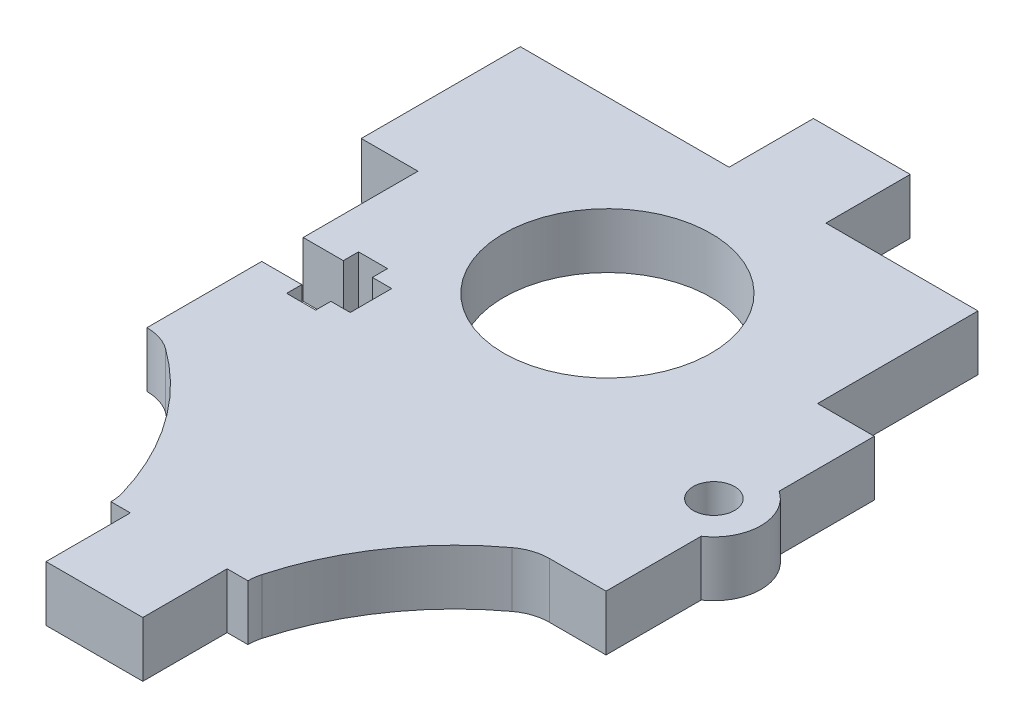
ISO-10303-21;
HEADER;
FILE_DESCRIPTION(('STEP AP214'),'2;1');
FILE_NAME('part.step','',(''),(''),'','','');
FILE_SCHEMA(('AUTOMOTIVE_DESIGN { 1 0 10303 214 1 1 1 1 }'));
ENDSEC;
DATA;
#1=APPLICATION_CONTEXT('core data for automotive mechanical design processes');
#2=APPLICATION_PROTOCOL_DEFINITION('international standard','automotive_design',2000,#1);
#3=PRODUCT_CONTEXT('',#1,'mechanical');
#4=PRODUCT('Part','Part','',(#3));
#5=PRODUCT_RELATED_PRODUCT_CATEGORY('part','',(#4));
#6=PRODUCT_DEFINITION_FORMATION('','',#4);
#7=PRODUCT_DEFINITION_CONTEXT('part definition',#1,'design');
#8=PRODUCT_DEFINITION('design','',#6,#7);
#9=PRODUCT_DEFINITION_SHAPE('','',#8);
#10=(LENGTH_UNIT() NAMED_UNIT(*) SI_UNIT(.MILLI.,.METRE.));
#11=(NAMED_UNIT(*) PLANE_ANGLE_UNIT() SI_UNIT($,.RADIAN.));
#12=(NAMED_UNIT(*) SI_UNIT($,.STERADIAN.) SOLID_ANGLE_UNIT());
#13=UNCERTAINTY_MEASURE_WITH_UNIT(LENGTH_MEASURE(1.E-05),#10,'distance_accuracy_value','');
#14=(GEOMETRIC_REPRESENTATION_CONTEXT(3) GLOBAL_UNCERTAINTY_ASSIGNED_CONTEXT((#13)) GLOBAL_UNIT_ASSIGNED_CONTEXT((#10,
#11,#12)) REPRESENTATION_CONTEXT('',''));
#15=CARTESIAN_POINT('',(0.,0.,0.));
#16=DIRECTION('',(0.,0.,1.));
#17=DIRECTION('',(1.,0.,0.));
#18=AXIS2_PLACEMENT_3D('',#15,#16,#17);
#19=CARTESIAN_POINT('',(-9.5,-2.,-2.6));
#20=DIRECTION('',(-1.,0.,0.));
#21=DIRECTION('',(0.,0.,1.));
#22=AXIS2_PLACEMENT_3D('',#19,#20,#21);
#23=PLANE('',#22);
#24=DIRECTION('',(0.,1.,0.));
#25=VECTOR('',#24,1.);
#26=CARTESIAN_POINT('',(-9.5,-2.,-2.6));
#27=LINE('',#26,#25);
#28=CARTESIAN_POINT('',(-9.5,-2.,-2.6));
#29=VERTEX_POINT('',#28);
#30=CARTESIAN_POINT('',(-9.5,2.,-2.6));
#31=VERTEX_POINT('',#30);
#32=EDGE_CURVE('E604',#29,#31,#27,.T.);
#33=ORIENTED_EDGE('',*,*,#32,.F.);
#34=DIRECTION('',(0.,0.,1.));
#35=VECTOR('',#34,1.);
#36=CARTESIAN_POINT('',(-9.5,-2.,-2.6));
#37=LINE('',#36,#35);
#38=CARTESIAN_POINT('',(-9.5,-2.,-1.5));
#39=VERTEX_POINT('',#38);
#40=EDGE_CURVE('E423',#29,#39,#37,.T.);
#41=ORIENTED_EDGE('',*,*,#40,.T.);
#42=DIRECTION('',(0.,1.,0.));
#43=VECTOR('',#42,1.);
#44=CARTESIAN_POINT('',(-9.5,-2.,-1.5));
#45=LINE('',#44,#43);
#46=CARTESIAN_POINT('',(-9.5,2.,-1.5));
#47=VERTEX_POINT('',#46);
#48=EDGE_CURVE('E693',#47,#39,#45,.F.);
#49=ORIENTED_EDGE('',*,*,#48,.F.);
#50=DIRECTION('',(0.,0.,1.));
#51=VECTOR('',#50,1.);
#52=CARTESIAN_POINT('',(-9.5,2.,0.));
#53=LINE('',#52,#51);
#54=EDGE_CURVE('E419',#31,#47,#53,.T.);
#55=ORIENTED_EDGE('',*,*,#54,.F.);
#56=EDGE_LOOP('',(#33,#41,#49,#55));
#57=FACE_BOUND('',#56,.T.);
#58=ADVANCED_FACE('F17',(#57),#23,.T.);
#59=CARTESIAN_POINT('',(-11.6,-2.,-1.5));
#60=DIRECTION('',(1.,0.,0.));
#61=DIRECTION('',(0.,0.,-1.));
#62=AXIS2_PLACEMENT_3D('',#59,#60,#61);
#63=PLANE('',#62);
#64=DIRECTION('',(0.,1.,0.));
#65=VECTOR('',#64,1.);
#66=CARTESIAN_POINT('',(-11.6,-2.,-1.5));
#67=LINE('',#66,#65);
#68=CARTESIAN_POINT('',(-11.6,-2.,-1.5));
#69=VERTEX_POINT('',#68);
#70=CARTESIAN_POINT('',(-11.6,2.,-1.5));
#71=VERTEX_POINT('',#70);
#72=EDGE_CURVE('E612',#69,#71,#67,.T.);
#73=ORIENTED_EDGE('',*,*,#72,.F.);
#74=DIRECTION('',(0.,0.,-1.));
#75=VECTOR('',#74,1.);
#76=CARTESIAN_POINT('',(-11.6,-2.,-1.5));
#77=LINE('',#76,#75);
#78=CARTESIAN_POINT('',(-11.6,-2.,-2.6));
#79=VERTEX_POINT('',#78);
#80=EDGE_CURVE('E699',#69,#79,#77,.T.);
#81=ORIENTED_EDGE('',*,*,#80,.T.);
#82=DIRECTION('',(0.,1.,0.));
#83=VECTOR('',#82,1.);
#84=CARTESIAN_POINT('',(-11.6,-2.,-2.6));
#85=LINE('',#84,#83);
#86=CARTESIAN_POINT('',(-11.6,2.,-2.6));
#87=VERTEX_POINT('',#86);
#88=EDGE_CURVE('E596',#87,#79,#85,.F.);
#89=ORIENTED_EDGE('',*,*,#88,.F.);
#90=DIRECTION('',(0.,0.,1.));
#91=VECTOR('',#90,1.);
#92=CARTESIAN_POINT('',(-11.6,2.,0.));
#93=LINE('',#92,#91);
#94=EDGE_CURVE('E412',#71,#87,#93,.F.);
#95=ORIENTED_EDGE('',*,*,#94,.F.);
#96=EDGE_LOOP('',(#73,#81,#89,#95));
#97=FACE_BOUND('',#96,.T.);
#98=ADVANCED_FACE('F732',(#97),#63,.T.);
#99=CARTESIAN_POINT('',(-8.1,-2.,1.5));
#100=DIRECTION('',(0.,0.,-1.));
#101=DIRECTION('',(-1.,0.,0.));
#102=AXIS2_PLACEMENT_3D('',#99,#100,#101);
#103=PLANE('',#102);
#104=DIRECTION('',(0.,1.,0.));
#105=VECTOR('',#104,1.);
#106=CARTESIAN_POINT('',(-8.1,-2.,1.5));
#107=LINE('',#106,#105);
#108=CARTESIAN_POINT('',(-8.1,-2.,1.5));
#109=VERTEX_POINT('',#108);
#110=CARTESIAN_POINT('',(-8.1,2.,1.5));
#111=VERTEX_POINT('',#110);
#112=EDGE_CURVE('E593',#109,#111,#107,.T.);
#113=ORIENTED_EDGE('',*,*,#112,.F.);
#114=DIRECTION('',(-1.,0.,0.));
#115=VECTOR('',#114,1.);
#116=CARTESIAN_POINT('',(-8.1,-2.,1.5));
#117=LINE('',#116,#115);
#118=CARTESIAN_POINT('',(-9.5,-2.,1.5));
#119=VERTEX_POINT('',#118);
#120=EDGE_CURVE('E697',#109,#119,#117,.T.);
#121=ORIENTED_EDGE('',*,*,#120,.T.);
#122=DIRECTION('',(0.,1.,0.));
#123=VECTOR('',#122,1.);
#124=CARTESIAN_POINT('',(-9.5,-2.,1.5));
#125=LINE('',#124,#123);
#126=CARTESIAN_POINT('',(-9.5,2.,1.5));
#127=VERTEX_POINT('',#126);
#128=EDGE_CURVE('E686',#127,#119,#125,.F.);
#129=ORIENTED_EDGE('',*,*,#128,.F.);
#130=DIRECTION('',(1.,0.,0.));
#131=VECTOR('',#130,1.);
#132=CARTESIAN_POINT('',(0.,2.,1.5));
#133=LINE('',#132,#131);
#134=EDGE_CURVE('E638',#111,#127,#133,.F.);
#135=ORIENTED_EDGE('',*,*,#134,.F.);
#136=EDGE_LOOP('',(#113,#121,#129,#135));
#137=FACE_BOUND('',#136,.T.);
#138=ADVANCED_FACE('F1092',(#137),#103,.T.);
#139=CARTESIAN_POINT('',(-9.5,-2.,-1.5));
#140=DIRECTION('',(0.,0.,1.));
#141=DIRECTION('',(1.,0.,0.));
#142=AXIS2_PLACEMENT_3D('',#139,#140,#141);
#143=PLANE('',#142);
#144=ORIENTED_EDGE('',*,*,#48,.T.);
#145=DIRECTION('',(1.,0.,0.));
#146=VECTOR('',#145,1.);
#147=CARTESIAN_POINT('',(-9.5,-2.,-1.5));
#148=LINE('',#147,#146);
#149=CARTESIAN_POINT('',(-8.1,-2.,-1.5));
#150=VERTEX_POINT('',#149);
#151=EDGE_CURVE('E690',#39,#150,#148,.T.);
#152=ORIENTED_EDGE('',*,*,#151,.T.);
#153=DIRECTION('',(0.,1.,0.));
#154=VECTOR('',#153,1.);
#155=CARTESIAN_POINT('',(-8.1,-2.,-1.5));
#156=LINE('',#155,#154);
#157=CARTESIAN_POINT('',(-8.1,2.,-1.5));
#158=VERTEX_POINT('',#157);
#159=EDGE_CURVE('E448',#158,#150,#156,.F.);
#160=ORIENTED_EDGE('',*,*,#159,.F.);
#161=DIRECTION('',(1.,0.,0.));
#162=VECTOR('',#161,1.);
#163=CARTESIAN_POINT('',(0.,2.,-1.5));
#164=LINE('',#163,#162);
#165=EDGE_CURVE('E641',#47,#158,#164,.T.);
#166=ORIENTED_EDGE('',*,*,#165,.F.);
#167=EDGE_LOOP('',(#144,#152,#160,#166));
#168=FACE_BOUND('',#167,.T.);
#169=ADVANCED_FACE('F714',(#168),#143,.T.);
#170=CARTESIAN_POINT('',(-9.5,-2.,1.5));
#171=DIRECTION('',(-1.,0.,0.));
#172=DIRECTION('',(0.,0.,1.));
#173=AXIS2_PLACEMENT_3D('',#170,#171,#172);
#174=PLANE('',#173);
#175=ORIENTED_EDGE('',*,*,#128,.T.);
#176=DIRECTION('',(0.,0.,1.));
#177=VECTOR('',#176,1.);
#178=CARTESIAN_POINT('',(-9.5,-2.,1.5));
#179=LINE('',#178,#177);
#180=CARTESIAN_POINT('',(-9.5,-2.,2.6));
#181=VERTEX_POINT('',#180);
#182=EDGE_CURVE('E678',#119,#181,#179,.T.);
#183=ORIENTED_EDGE('',*,*,#182,.T.);
#184=DIRECTION('',(0.,1.,0.));
#185=VECTOR('',#184,1.);
#186=CARTESIAN_POINT('',(-9.5,-2.,2.6));
#187=LINE('',#186,#185);
#188=CARTESIAN_POINT('',(-9.5,2.,2.6));
#189=VERTEX_POINT('',#188);
#190=EDGE_CURVE('E453',#189,#181,#187,.F.);
#191=ORIENTED_EDGE('',*,*,#190,.F.);
#192=DIRECTION('',(0.,0.,1.));
#193=VECTOR('',#192,1.);
#194=CARTESIAN_POINT('',(-9.5,2.,0.));
#195=LINE('',#194,#193);
#196=EDGE_CURVE('E635',#127,#189,#195,.T.);
#197=ORIENTED_EDGE('',*,*,#196,.F.);
#198=EDGE_LOOP('',(#175,#183,#191,#197));
#199=FACE_BOUND('',#198,.T.);
#200=ADVANCED_FACE('F1077',(#199),#174,.T.);
#201=CARTESIAN_POINT('',(-11.6,-2.,2.6));
#202=DIRECTION('',(1.,0.,0.));
#203=DIRECTION('',(0.,0.,-1.));
#204=AXIS2_PLACEMENT_3D('',#201,#202,#203);
#205=PLANE('',#204);
#206=DIRECTION('',(0.,1.,0.));
#207=VECTOR('',#206,1.);
#208=CARTESIAN_POINT('',(-11.6,-2.,2.6));
#209=LINE('',#208,#207);
#210=CARTESIAN_POINT('',(-11.6,-2.,2.6));
#211=VERTEX_POINT('',#210);
#212=CARTESIAN_POINT('',(-11.6,2.,2.6));
#213=VERTEX_POINT('',#212);
#214=EDGE_CURVE('E445',#211,#213,#209,.T.);
#215=ORIENTED_EDGE('',*,*,#214,.F.);
#216=DIRECTION('',(0.,0.,-1.));
#217=VECTOR('',#216,1.);
#218=CARTESIAN_POINT('',(-11.6,-2.,2.6));
#219=LINE('',#218,#217);
#220=CARTESIAN_POINT('',(-11.6,-2.,1.5));
#221=VERTEX_POINT('',#220);
#222=EDGE_CURVE('E310',#211,#221,#219,.T.);
#223=ORIENTED_EDGE('',*,*,#222,.T.);
#224=DIRECTION('',(0.,1.,0.));
#225=VECTOR('',#224,1.);
#226=CARTESIAN_POINT('',(-11.6,-2.,1.5));
#227=LINE('',#226,#225);
#228=CARTESIAN_POINT('',(-11.6,2.,1.5));
#229=VERTEX_POINT('',#228);
#230=EDGE_CURVE('E578',#229,#221,#227,.F.);
#231=ORIENTED_EDGE('',*,*,#230,.F.);
#232=DIRECTION('',(0.,0.,1.));
#233=VECTOR('',#232,1.);
#234=CARTESIAN_POINT('',(-11.6,2.,0.));
#235=LINE('',#234,#233);
#236=EDGE_CURVE('E407',#213,#229,#235,.F.);
#237=ORIENTED_EDGE('',*,*,#236,.F.);
#238=EDGE_LOOP('',(#215,#223,#231,#237));
#239=FACE_BOUND('',#238,.T.);
#240=ADVANCED_FACE('F1070',(#239),#205,.T.);
#241=CARTESIAN_POINT('',(-8.3,-2.,22.));
#242=DIRECTION('',(0.,1.,0.));
#243=DIRECTION('',(0.,0.,1.));
#244=AXIS2_PLACEMENT_3D('',#241,#242,#243);
#245=CYLINDRICAL_SURFACE('',#244,3.4);
#246=CARTESIAN_POINT('',(-8.3,2.,22.));
#247=DIRECTION('',(0.,1.,0.));
#248=DIRECTION('',(0.,0.,1.));
#249=AXIS2_PLACEMENT_3D('',#246,#247,#248);
#250=CIRCLE('',#249,3.4);
#251=CARTESIAN_POINT('',(-5.03577933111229,2.,21.0487569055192));
#252=VERTEX_POINT('',#251);
#253=CARTESIAN_POINT('',(-4.9,2.,22.));
#254=VERTEX_POINT('',#253);
#255=EDGE_CURVE('E406',#252,#254,#250,.F.);
#256=ORIENTED_EDGE('',*,*,#255,.F.);
#257=DIRECTION('',(0.,1.,0.));
#258=VECTOR('',#257,1.);
#259=CARTESIAN_POINT('',(-5.03577933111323,-2.,21.0487569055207));
#260=LINE('',#259,#258);
#261=CARTESIAN_POINT('',(-5.03577933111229,-2.,21.0487569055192));
#262=VERTEX_POINT('',#261);
#263=EDGE_CURVE('E305',#252,#262,#260,.F.);
#264=ORIENTED_EDGE('',*,*,#263,.T.);
#265=CARTESIAN_POINT('',(-8.3,-2.,22.));
#266=DIRECTION('',(0.,1.,0.));
#267=DIRECTION('',(0.,0.,1.));
#268=AXIS2_PLACEMENT_3D('',#265,#266,#267);
#269=CIRCLE('',#268,3.4);
#270=CARTESIAN_POINT('',(-4.9,-2.,22.));
#271=VERTEX_POINT('',#270);
#272=EDGE_CURVE('E20',#271,#262,#269,.T.);
#273=ORIENTED_EDGE('',*,*,#272,.F.);
#274=DIRECTION('',(0.,1.,0.));
#275=VECTOR('',#274,1.);
#276=CARTESIAN_POINT('',(-4.9,-2.,22.));
#277=LINE('',#276,#275);
#278=EDGE_CURVE('E302',#254,#271,#277,.F.);
#279=ORIENTED_EDGE('',*,*,#278,.F.);
#280=EDGE_LOOP('',(#256,#264,#273,#279));
#281=FACE_BOUND('',#280,.T.);
#282=ADVANCED_FACE('F301',(#281),#245,.F.);
#283=CARTESIAN_POINT('',(-4.9,-2.,22.));
#284=DIRECTION('',(0.,0.,1.));
#285=DIRECTION('',(1.,0.,0.));
#286=AXIS2_PLACEMENT_3D('',#283,#284,#285);
#287=PLANE('',#286);
#288=ORIENTED_EDGE('',*,*,#278,.T.);
#289=DIRECTION('',(1.,0.,0.));
#290=VECTOR('',#289,1.);
#291=CARTESIAN_POINT('',(-4.9,-2.,22.));
#292=LINE('',#291,#290);
#293=CARTESIAN_POINT('',(-3.5,-2.,22.));
#294=VERTEX_POINT('',#293);
#295=EDGE_CURVE('E314',#271,#294,#292,.T.);
#296=ORIENTED_EDGE('',*,*,#295,.T.);
#297=DIRECTION('',(0.,1.,0.));
#298=VECTOR('',#297,1.);
#299=CARTESIAN_POINT('',(-3.5,-2.,22.));
#300=LINE('',#299,#298);
#301=CARTESIAN_POINT('',(-3.5,2.,22.));
#302=VERTEX_POINT('',#301);
#303=EDGE_CURVE('E438',#302,#294,#300,.F.);
#304=ORIENTED_EDGE('',*,*,#303,.F.);
#305=DIRECTION('',(1.,0.,0.));
#306=VECTOR('',#305,1.);
#307=CARTESIAN_POINT('',(0.,2.,22.));
#308=LINE('',#307,#306);
#309=EDGE_CURVE('E316',#254,#302,#308,.T.);
#310=ORIENTED_EDGE('',*,*,#309,.F.);
#311=EDGE_LOOP('',(#288,#296,#304,#310));
#312=FACE_BOUND('',#311,.T.);
#313=ADVANCED_FACE('F312',(#312),#287,.T.);
#314=CARTESIAN_POINT('',(3.5,-2.,22.));
#315=DIRECTION('',(0.,0.,1.));
#316=DIRECTION('',(1.,0.,0.));
#317=AXIS2_PLACEMENT_3D('',#314,#315,#316);
#318=PLANE('',#317);
#319=DIRECTION('',(0.,1.,0.));
#320=VECTOR('',#319,1.);
#321=CARTESIAN_POINT('',(3.5,-2.,22.));
#322=LINE('',#321,#320);
#323=CARTESIAN_POINT('',(3.5,-2.,22.));
#324=VERTEX_POINT('',#323);
#325=CARTESIAN_POINT('',(3.5,2.,22.));
#326=VERTEX_POINT('',#325);
#327=EDGE_CURVE('E425',#324,#326,#322,.T.);
#328=ORIENTED_EDGE('',*,*,#327,.F.);
#329=DIRECTION('',(1.,0.,0.));
#330=VECTOR('',#329,1.);
#331=CARTESIAN_POINT('',(3.5,-2.,22.));
#332=LINE('',#331,#330);
#333=CARTESIAN_POINT('',(5.,-2.,22.));
#334=VERTEX_POINT('',#333);
#335=EDGE_CURVE('E324',#324,#334,#332,.T.);
#336=ORIENTED_EDGE('',*,*,#335,.T.);
#337=DIRECTION('',(0.,1.,0.));
#338=VECTOR('',#337,1.);
#339=CARTESIAN_POINT('',(5.,-2.,22.));
#340=LINE('',#339,#338);
#341=CARTESIAN_POINT('',(5.,2.,22.));
#342=VERTEX_POINT('',#341);
#343=EDGE_CURVE('E409',#334,#342,#340,.T.);
#344=ORIENTED_EDGE('',*,*,#343,.T.);
#345=DIRECTION('',(1.,0.,0.));
#346=VECTOR('',#345,1.);
#347=CARTESIAN_POINT('',(0.,2.,22.));
#348=LINE('',#347,#346);
#349=EDGE_CURVE('E405',#326,#342,#348,.T.);
#350=ORIENTED_EDGE('',*,*,#349,.F.);
#351=EDGE_LOOP('',(#328,#336,#344,#350));
#352=FACE_BOUND('',#351,.T.);
#353=ADVANCED_FACE('F805',(#352),#318,.T.);
#354=CARTESIAN_POINT('',(8.4,-2.,22.));
#355=DIRECTION('',(0.,1.,0.));
#356=DIRECTION('',(0.,0.,1.));
#357=AXIS2_PLACEMENT_3D('',#354,#355,#356);
#358=CYLINDRICAL_SURFACE('',#357,3.4);
#359=CARTESIAN_POINT('',(8.4,2.,22.));
#360=DIRECTION('',(0.,1.,0.));
#361=DIRECTION('',(0.,0.,1.));
#362=AXIS2_PLACEMENT_3D('',#359,#360,#361);
#363=CIRCLE('',#362,3.4);
#364=CARTESIAN_POINT('',(5.12304267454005,2.,21.093605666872));
#365=VERTEX_POINT('',#364);
#366=EDGE_CURVE('E402',#342,#365,#363,.F.);
#367=ORIENTED_EDGE('',*,*,#366,.F.);
#368=ORIENTED_EDGE('',*,*,#343,.F.);
#369=CARTESIAN_POINT('',(8.4,-2.,22.));
#370=DIRECTION('',(0.,1.,0.));
#371=DIRECTION('',(0.,0.,1.));
#372=AXIS2_PLACEMENT_3D('',#369,#370,#371);
#373=CIRCLE('',#372,3.4);
#374=CARTESIAN_POINT('',(5.12304267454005,-2.,21.093605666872));
#375=VERTEX_POINT('',#374);
#376=EDGE_CURVE('E326',#375,#334,#373,.T.);
#377=ORIENTED_EDGE('',*,*,#376,.F.);
#378=DIRECTION('',(0.,1.,0.));
#379=VECTOR('',#378,1.);
#380=CARTESIAN_POINT('',(5.12304267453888,-2.,21.0936056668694));
#381=LINE('',#380,#379);
#382=EDGE_CURVE('E394',#375,#365,#381,.T.);
#383=ORIENTED_EDGE('',*,*,#382,.T.);
#384=EDGE_LOOP('',(#367,#368,#377,#383));
#385=FACE_BOUND('',#384,.T.);
#386=ADVANCED_FACE('F801',(#385),#358,.F.);
#387=CARTESIAN_POINT('',(0.,2.,0.));
#388=DIRECTION('',(0.,1.,0.));
#389=DIRECTION('',(0.,0.,1.));
#390=AXIS2_PLACEMENT_3D('',#387,#388,#389);
#391=PLANE('',#390);
#392=CARTESIAN_POINT('',(0.,2.,-9.));
#393=DIRECTION('',(0.,1.,0.));
#394=DIRECTION('',(0.,0.,1.));
#395=AXIS2_PLACEMENT_3D('',#392,#393,#394);
#396=CIRCLE('',#395,7.5);
#397=CARTESIAN_POINT('',(0.,2.,-1.5));
#398=VERTEX_POINT('',#397);
#399=EDGE_CURVE('E371',#398,#398,#396,.F.);
#400=ORIENTED_EDGE('',*,*,#399,.T.);
#401=EDGE_LOOP('',(#400));
#402=FACE_BOUND('',#401,.T.);
#403=CARTESIAN_POINT('',(16.7,2.,0.));
#404=DIRECTION('',(0.,1.,0.));
#405=DIRECTION('',(0.,0.,1.));
#406=AXIS2_PLACEMENT_3D('',#403,#404,#405);
#407=CIRCLE('',#406,1.5);
#408=CARTESIAN_POINT('',(16.7,2.,1.5));
#409=VERTEX_POINT('',#408);
#410=EDGE_CURVE('E376',#409,#409,#407,.F.);
#411=ORIENTED_EDGE('',*,*,#410,.T.);
#412=EDGE_LOOP('',(#411));
#413=FACE_BOUND('',#412,.T.);
#414=DIRECTION('',(-1.,0.,0.));
#415=VECTOR('',#414,1.);
#416=CARTESIAN_POINT('',(-3.5,2.,-21.3));
#417=LINE('',#416,#415);
#418=CARTESIAN_POINT('',(-18.6,2.,-21.3));
#419=VERTEX_POINT('',#418);
#420=CARTESIAN_POINT('',(-3.5,2.,-21.3));
#421=VERTEX_POINT('',#420);
#422=EDGE_CURVE('E496',#419,#421,#417,.F.);
#423=ORIENTED_EDGE('',*,*,#422,.F.);
#424=DIRECTION('',(0.,0.,1.));
#425=VECTOR('',#424,1.);
#426=CARTESIAN_POINT('',(-18.6,2.,-21.3));
#427=LINE('',#426,#425);
#428=CARTESIAN_POINT('',(-18.6,2.,-9.8));
#429=VERTEX_POINT('',#428);
#430=EDGE_CURVE('E404',#429,#419,#427,.F.);
#431=ORIENTED_EDGE('',*,*,#430,.F.);
#432=DIRECTION('',(1.,0.,0.));
#433=VECTOR('',#432,1.);
#434=CARTESIAN_POINT('',(-18.6,2.,-9.8));
#435=LINE('',#434,#433);
#436=CARTESIAN_POINT('',(-14.5,2.,-9.8));
#437=VERTEX_POINT('',#436);
#438=EDGE_CURVE('E624',#437,#429,#435,.F.);
#439=ORIENTED_EDGE('',*,*,#438,.F.);
#440=DIRECTION('',(0.,0.,1.));
#441=VECTOR('',#440,1.);
#442=CARTESIAN_POINT('',(-14.5,2.,-9.8));
#443=LINE('',#442,#441);
#444=CARTESIAN_POINT('',(-14.5,2.,-1.5));
#445=VERTEX_POINT('',#444);
#446=EDGE_CURVE('E618',#445,#437,#443,.F.);
#447=ORIENTED_EDGE('',*,*,#446,.F.);
#448=DIRECTION('',(1.,0.,0.));
#449=VECTOR('',#448,1.);
#450=CARTESIAN_POINT('',(-14.5,2.,-1.5));
#451=LINE('',#450,#449);
#452=EDGE_CURVE('E609',#71,#445,#451,.F.);
#453=ORIENTED_EDGE('',*,*,#452,.F.);
#454=ORIENTED_EDGE('',*,*,#94,.T.);
#455=DIRECTION('',(1.,0.,0.));
#456=VECTOR('',#455,1.);
#457=CARTESIAN_POINT('',(-11.6,2.,-2.6));
#458=LINE('',#457,#456);
#459=EDGE_CURVE('E600',#31,#87,#458,.F.);
#460=ORIENTED_EDGE('',*,*,#459,.F.);
#461=ORIENTED_EDGE('',*,*,#54,.T.);
#462=ORIENTED_EDGE('',*,*,#165,.T.);
#463=DIRECTION('',(0.,0.,1.));
#464=VECTOR('',#463,1.);
#465=CARTESIAN_POINT('',(-8.1,2.,-1.5));
#466=LINE('',#465,#464);
#467=EDGE_CURVE('E589',#111,#158,#466,.F.);
#468=ORIENTED_EDGE('',*,*,#467,.F.);
#469=ORIENTED_EDGE('',*,*,#134,.T.);
#470=ORIENTED_EDGE('',*,*,#196,.T.);
#471=DIRECTION('',(-1.,0.,0.));
#472=VECTOR('',#471,1.);
#473=CARTESIAN_POINT('',(-9.5,2.,2.6));
#474=LINE('',#473,#472);
#475=EDGE_CURVE('E447',#213,#189,#474,.F.);
#476=ORIENTED_EDGE('',*,*,#475,.F.);
#477=ORIENTED_EDGE('',*,*,#236,.T.);
#478=DIRECTION('',(-1.,0.,0.));
#479=VECTOR('',#478,1.);
#480=CARTESIAN_POINT('',(-11.6,2.,1.5));
#481=LINE('',#480,#479);
#482=CARTESIAN_POINT('',(-14.5,2.,1.5));
#483=VERTEX_POINT('',#482);
#484=EDGE_CURVE('E581',#483,#229,#481,.F.);
#485=ORIENTED_EDGE('',*,*,#484,.F.);
#486=DIRECTION('',(0.,0.,1.));
#487=VECTOR('',#486,1.);
#488=CARTESIAN_POINT('',(-14.5,2.,1.5));
#489=LINE('',#488,#487);
#490=CARTESIAN_POINT('',(-14.5,2.,9.8));
#491=VERTEX_POINT('',#490);
#492=EDGE_CURVE('E571',#491,#483,#489,.F.);
#493=ORIENTED_EDGE('',*,*,#492,.F.);
#494=CARTESIAN_POINT('',(-14.5,2.,13.2));
#495=DIRECTION('',(0.,1.,0.));
#496=DIRECTION('',(0.,0.,1.));
#497=AXIS2_PLACEMENT_3D('',#494,#495,#496);
#498=CIRCLE('',#497,3.4);
#499=CARTESIAN_POINT('',(-12.5056588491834,2.,10.4463472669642));
#500=VERTEX_POINT('',#499);
#501=EDGE_CURVE('E399',#491,#500,#498,.F.);
#502=ORIENTED_EDGE('',*,*,#501,.T.);
#503=CARTESIAN_POINT('',(-24.2370773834,2.,26.64430452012));
#504=DIRECTION('',(0.,1.,0.));
#505=DIRECTION('',(0.,0.,1.));
#506=AXIS2_PLACEMENT_3D('',#503,#504,#505);
#507=CIRCLE('',#506,20.);
#508=EDGE_CURVE('E395',#500,#252,#507,.F.);
#509=ORIENTED_EDGE('',*,*,#508,.T.);
#510=ORIENTED_EDGE('',*,*,#255,.T.);
#511=ORIENTED_EDGE('',*,*,#309,.T.);
#512=DIRECTION('',(0.,0.,1.));
#513=VECTOR('',#512,1.);
#514=CARTESIAN_POINT('',(-3.5,2.,22.));
#515=LINE('',#514,#513);
#516=CARTESIAN_POINT('',(-3.5,2.,28.1));
#517=VERTEX_POINT('',#516);
#518=EDGE_CURVE('E435',#517,#302,#515,.F.);
#519=ORIENTED_EDGE('',*,*,#518,.F.);
#520=DIRECTION('',(1.,0.,0.));
#521=VECTOR('',#520,1.);
#522=CARTESIAN_POINT('',(-3.5,2.,28.1));
#523=LINE('',#522,#521);
#524=CARTESIAN_POINT('',(3.5,2.,28.1));
#525=VERTEX_POINT('',#524);
#526=EDGE_CURVE('E442',#525,#517,#523,.F.);
#527=ORIENTED_EDGE('',*,*,#526,.F.);
#528=DIRECTION('',(0.,0.,-1.));
#529=VECTOR('',#528,1.);
#530=CARTESIAN_POINT('',(3.5,2.,28.1));
#531=LINE('',#530,#529);
#532=EDGE_CURVE('E427',#326,#525,#531,.F.);
#533=ORIENTED_EDGE('',*,*,#532,.F.);
#534=ORIENTED_EDGE('',*,*,#349,.T.);
#535=ORIENTED_EDGE('',*,*,#366,.T.);
#536=CARTESIAN_POINT('',(24.39926223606,2.,26.4253370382));
#537=DIRECTION('',(0.,1.,0.));
#538=DIRECTION('',(0.,0.,1.));
#539=AXIS2_PLACEMENT_3D('',#536,#537,#538);
#540=CIRCLE('',#539,20.);
#541=CARTESIAN_POINT('',(12.472440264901,2.,10.3707141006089));
#542=VERTEX_POINT('',#541);
#543=EDGE_CURVE('E391',#365,#542,#540,.F.);
#544=ORIENTED_EDGE('',*,*,#543,.T.);
#545=CARTESIAN_POINT('',(14.5,2.,13.1));
#546=DIRECTION('',(0.,1.,0.));
#547=DIRECTION('',(0.,0.,1.));
#548=AXIS2_PLACEMENT_3D('',#545,#546,#547);
#549=CIRCLE('',#548,3.4);
#550=CARTESIAN_POINT('',(14.5,2.,9.7));
#551=VERTEX_POINT('',#550);
#552=EDGE_CURVE('E385',#542,#551,#549,.F.);
#553=ORIENTED_EDGE('',*,*,#552,.T.);
#554=DIRECTION('',(1.,0.,0.));
#555=VECTOR('',#554,1.);
#556=CARTESIAN_POINT('',(14.5,2.,9.7));
#557=LINE('',#556,#555);
#558=CARTESIAN_POINT('',(18.6,2.,9.7));
#559=VERTEX_POINT('',#558);
#560=EDGE_CURVE('E389',#559,#551,#557,.F.);
#561=ORIENTED_EDGE('',*,*,#560,.F.);
#562=DIRECTION('',(0.,0.,-1.));
#563=VECTOR('',#562,1.);
#564=CARTESIAN_POINT('',(18.6,2.,9.7));
#565=LINE('',#564,#563);
#566=CARTESIAN_POINT('',(18.6000000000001,2.,2.81957443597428));
#567=VERTEX_POINT('',#566);
#568=EDGE_CURVE('E550',#567,#559,#565,.F.);
#569=ORIENTED_EDGE('',*,*,#568,.F.);
#570=CARTESIAN_POINT('',(16.7,2.,0.));
#571=DIRECTION('',(0.,1.,0.));
#572=DIRECTION('',(0.,0.,1.));
#573=AXIS2_PLACEMENT_3D('',#570,#571,#572);
#574=CIRCLE('',#573,3.4);
#575=CARTESIAN_POINT('',(18.6,2.,-2.81957443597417));
#576=VERTEX_POINT('',#575);
#577=EDGE_CURVE('E380',#576,#567,#574,.F.);
#578=ORIENTED_EDGE('',*,*,#577,.F.);
#579=DIRECTION('',(0.,0.,-1.));
#580=VECTOR('',#579,1.);
#581=CARTESIAN_POINT('',(18.6,2.,-2.819574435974));
#582=LINE('',#581,#580);
#583=CARTESIAN_POINT('',(18.6,2.,-9.7));
#584=VERTEX_POINT('',#583);
#585=EDGE_CURVE('E532',#584,#576,#582,.F.);
#586=ORIENTED_EDGE('',*,*,#585,.F.);
#587=DIRECTION('',(-1.,0.,0.));
#588=VECTOR('',#587,1.);
#589=CARTESIAN_POINT('',(18.6,2.,-9.7));
#590=LINE('',#589,#588);
#591=CARTESIAN_POINT('',(14.5,2.,-9.7));
#592=VERTEX_POINT('',#591);
#593=EDGE_CURVE('E531',#592,#584,#590,.F.);
#594=ORIENTED_EDGE('',*,*,#593,.F.);
#595=DIRECTION('',(0.,0.,-1.));
#596=VECTOR('',#595,1.);
#597=CARTESIAN_POINT('',(14.5,2.,-9.7));
#598=LINE('',#597,#596);
#599=CARTESIAN_POINT('',(14.5,2.,-21.3));
#600=VERTEX_POINT('',#599);
#601=EDGE_CURVE('E543',#600,#592,#598,.F.);
#602=ORIENTED_EDGE('',*,*,#601,.F.);
#603=DIRECTION('',(-1.,0.,0.));
#604=VECTOR('',#603,1.);
#605=CARTESIAN_POINT('',(14.5,2.,-21.3));
#606=LINE('',#605,#604);
#607=CARTESIAN_POINT('',(3.5,2.,-21.3));
#608=VERTEX_POINT('',#607);
#609=EDGE_CURVE('E524',#608,#600,#606,.F.);
#610=ORIENTED_EDGE('',*,*,#609,.F.);
#611=DIRECTION('',(0.,0.,-1.));
#612=VECTOR('',#611,1.);
#613=CARTESIAN_POINT('',(3.5,2.,-21.3));
#614=LINE('',#613,#612);
#615=CARTESIAN_POINT('',(3.5,2.,-27.4));
#616=VERTEX_POINT('',#615);
#617=EDGE_CURVE('E518',#616,#608,#614,.F.);
#618=ORIENTED_EDGE('',*,*,#617,.F.);
#619=DIRECTION('',(-1.,0.,0.));
#620=VECTOR('',#619,1.);
#621=CARTESIAN_POINT('',(3.5,2.,-27.4));
#622=LINE('',#621,#620);
#623=CARTESIAN_POINT('',(-3.5,2.,-27.4));
#624=VERTEX_POINT('',#623);
#625=EDGE_CURVE('E512',#624,#616,#622,.F.);
#626=ORIENTED_EDGE('',*,*,#625,.F.);
#627=DIRECTION('',(0.,0.,1.));
#628=VECTOR('',#627,1.);
#629=CARTESIAN_POINT('',(-3.5,2.,-27.4));
#630=LINE('',#629,#628);
#631=EDGE_CURVE('E506',#421,#624,#630,.F.);
#632=ORIENTED_EDGE('',*,*,#631,.F.);
#633=EDGE_LOOP('',(#423,#431,#439,#447,#453,#454,#460,#461,#462,#468,#469,#470,#476,#477,#485,
#493,#502,#509,#510,#511,#519,#527,#533,#534,#535,#544,#553,#561,#569,#578,#586,#594,#602,#610,
#618,#626,#632));
#634=FACE_BOUND('',#633,.T.);
#635=ADVANCED_FACE('F725',(#402,#413,#634),#391,.T.);
#636=CARTESIAN_POINT('',(-18.6,-2.,-21.3));
#637=DIRECTION('',(-1.,0.,0.));
#638=DIRECTION('',(0.,0.,1.));
#639=AXIS2_PLACEMENT_3D('',#636,#637,#638);
#640=PLANE('',#639);
#641=DIRECTION('',(0.,1.,0.));
#642=VECTOR('',#641,1.);
#643=CARTESIAN_POINT('',(-18.6,-2.,-21.3));
#644=LINE('',#643,#642);
#645=CARTESIAN_POINT('',(-18.6,-2.,-21.3));
#646=VERTEX_POINT('',#645);
#647=EDGE_CURVE('E499',#646,#419,#644,.T.);
#648=ORIENTED_EDGE('',*,*,#647,.F.);
#649=DIRECTION('',(0.,0.,1.));
#650=VECTOR('',#649,1.);
#651=CARTESIAN_POINT('',(-18.6,-2.,0.));
#652=LINE('',#651,#650);
#653=CARTESIAN_POINT('',(-18.6,-2.,-9.8));
#654=VERTEX_POINT('',#653);
#655=EDGE_CURVE('E375',#646,#654,#652,.T.);
#656=ORIENTED_EDGE('',*,*,#655,.T.);
#657=DIRECTION('',(0.,1.,0.));
#658=VECTOR('',#657,1.);
#659=CARTESIAN_POINT('',(-18.6,-2.,-9.8));
#660=LINE('',#659,#658);
#661=EDGE_CURVE('E621',#429,#654,#660,.F.);
#662=ORIENTED_EDGE('',*,*,#661,.F.);
#663=ORIENTED_EDGE('',*,*,#430,.T.);
#664=EDGE_LOOP('',(#648,#656,#662,#663));
#665=FACE_BOUND('',#664,.T.);
#666=ADVANCED_FACE('F750',(#665),#640,.T.);
#667=CARTESIAN_POINT('',(-18.6,-2.,-9.8));
#668=DIRECTION('',(0.,0.,1.));
#669=DIRECTION('',(1.,0.,0.));
#670=AXIS2_PLACEMENT_3D('',#667,#668,#669);
#671=PLANE('',#670);
#672=ORIENTED_EDGE('',*,*,#661,.T.);
#673=DIRECTION('',(1.,0.,0.));
#674=VECTOR('',#673,1.);
#675=CARTESIAN_POINT('',(0.,-2.,-9.8));
#676=LINE('',#675,#674);
#677=CARTESIAN_POINT('',(-14.5,-2.,-9.8));
#678=VERTEX_POINT('',#677);
#679=EDGE_CURVE('E487',#654,#678,#676,.T.);
#680=ORIENTED_EDGE('',*,*,#679,.T.);
#681=DIRECTION('',(0.,1.,0.));
#682=VECTOR('',#681,1.);
#683=CARTESIAN_POINT('',(-14.5,-2.,-9.8));
#684=LINE('',#683,#682);
#685=EDGE_CURVE('E615',#437,#678,#684,.F.);
#686=ORIENTED_EDGE('',*,*,#685,.F.);
#687=ORIENTED_EDGE('',*,*,#438,.T.);
#688=EDGE_LOOP('',(#672,#680,#686,#687));
#689=FACE_BOUND('',#688,.T.);
#690=ADVANCED_FACE('F745',(#689),#671,.T.);
#691=CARTESIAN_POINT('',(-14.5,-2.,-9.8));
#692=DIRECTION('',(-1.,0.,0.));
#693=DIRECTION('',(0.,0.,1.));
#694=AXIS2_PLACEMENT_3D('',#691,#692,#693);
#695=PLANE('',#694);
#696=ORIENTED_EDGE('',*,*,#685,.T.);
#697=DIRECTION('',(0.,0.,1.));
#698=VECTOR('',#697,1.);
#699=CARTESIAN_POINT('',(-14.5,-2.,0.));
#700=LINE('',#699,#698);
#701=CARTESIAN_POINT('',(-14.5,-2.,-1.5));
#702=VERTEX_POINT('',#701);
#703=EDGE_CURVE('E483',#678,#702,#700,.T.);
#704=ORIENTED_EDGE('',*,*,#703,.T.);
#705=DIRECTION('',(0.,1.,0.));
#706=VECTOR('',#705,1.);
#707=CARTESIAN_POINT('',(-14.5,-2.,-1.5));
#708=LINE('',#707,#706);
#709=EDGE_CURVE('E607',#445,#702,#708,.F.);
#710=ORIENTED_EDGE('',*,*,#709,.F.);
#711=ORIENTED_EDGE('',*,*,#446,.T.);
#712=EDGE_LOOP('',(#696,#704,#710,#711));
#713=FACE_BOUND('',#712,.T.);
#714=ADVANCED_FACE('F742',(#713),#695,.T.);
#715=CARTESIAN_POINT('',(-14.5,-2.,-1.5));
#716=DIRECTION('',(0.,0.,1.));
#717=DIRECTION('',(1.,0.,0.));
#718=AXIS2_PLACEMENT_3D('',#715,#716,#717);
#719=PLANE('',#718);
#720=ORIENTED_EDGE('',*,*,#709,.T.);
#721=DIRECTION('',(1.,0.,0.));
#722=VECTOR('',#721,1.);
#723=CARTESIAN_POINT('',(0.,-2.,-1.5));
#724=LINE('',#723,#722);
#725=EDGE_CURVE('E479',#702,#69,#724,.T.);
#726=ORIENTED_EDGE('',*,*,#725,.T.);
#727=ORIENTED_EDGE('',*,*,#72,.T.);
#728=ORIENTED_EDGE('',*,*,#452,.T.);
#729=EDGE_LOOP('',(#720,#726,#727,#728));
#730=FACE_BOUND('',#729,.T.);
#731=ADVANCED_FACE('F737',(#730),#719,.T.);
#732=CARTESIAN_POINT('',(-11.6,-2.,-2.6));
#733=DIRECTION('',(0.,0.,1.));
#734=DIRECTION('',(1.,0.,0.));
#735=AXIS2_PLACEMENT_3D('',#732,#733,#734);
#736=PLANE('',#735);
#737=ORIENTED_EDGE('',*,*,#88,.T.);
#738=DIRECTION('',(1.,0.,0.));
#739=VECTOR('',#738,1.);
#740=CARTESIAN_POINT('',(0.,-2.,-2.6));
#741=LINE('',#740,#739);
#742=EDGE_CURVE('E475',#79,#29,#741,.T.);
#743=ORIENTED_EDGE('',*,*,#742,.T.);
#744=ORIENTED_EDGE('',*,*,#32,.T.);
#745=ORIENTED_EDGE('',*,*,#459,.T.);
#746=EDGE_LOOP('',(#737,#743,#744,#745));
#747=FACE_BOUND('',#746,.T.);
#748=ADVANCED_FACE('F731',(#747),#736,.T.);
#749=CARTESIAN_POINT('',(-8.1,-2.,-1.5));
#750=DIRECTION('',(-1.,0.,0.));
#751=DIRECTION('',(0.,0.,1.));
#752=AXIS2_PLACEMENT_3D('',#749,#750,#751);
#753=PLANE('',#752);
#754=ORIENTED_EDGE('',*,*,#159,.T.);
#755=DIRECTION('',(0.,0.,1.));
#756=VECTOR('',#755,1.);
#757=CARTESIAN_POINT('',(-8.1,-2.,0.));
#758=LINE('',#757,#756);
#759=EDGE_CURVE('E343',#150,#109,#758,.T.);
#760=ORIENTED_EDGE('',*,*,#759,.T.);
#761=ORIENTED_EDGE('',*,*,#112,.T.);
#762=ORIENTED_EDGE('',*,*,#467,.T.);
#763=EDGE_LOOP('',(#754,#760,#761,#762));
#764=FACE_BOUND('',#763,.T.);
#765=ADVANCED_FACE('F720',(#764),#753,.T.);
#766=CARTESIAN_POINT('',(-9.5,-2.,2.6));
#767=DIRECTION('',(0.,0.,-1.));
#768=DIRECTION('',(-1.,0.,0.));
#769=AXIS2_PLACEMENT_3D('',#766,#767,#768);
#770=PLANE('',#769);
#771=ORIENTED_EDGE('',*,*,#190,.T.);
#772=DIRECTION('',(1.,0.,0.));
#773=VECTOR('',#772,1.);
#774=CARTESIAN_POINT('',(0.,-2.,2.6));
#775=LINE('',#774,#773);
#776=EDGE_CURVE('E339',#181,#211,#775,.F.);
#777=ORIENTED_EDGE('',*,*,#776,.T.);
#778=ORIENTED_EDGE('',*,*,#214,.T.);
#779=ORIENTED_EDGE('',*,*,#475,.T.);
#780=EDGE_LOOP('',(#771,#777,#778,#779));
#781=FACE_BOUND('',#780,.T.);
#782=ADVANCED_FACE('F994',(#781),#770,.T.);
#783=CARTESIAN_POINT('',(-11.6,-2.,1.5));
#784=DIRECTION('',(0.,0.,-1.));
#785=DIRECTION('',(-1.,0.,0.));
#786=AXIS2_PLACEMENT_3D('',#783,#784,#785);
#787=PLANE('',#786);
#788=ORIENTED_EDGE('',*,*,#230,.T.);
#789=DIRECTION('',(1.,0.,0.));
#790=VECTOR('',#789,1.);
#791=CARTESIAN_POINT('',(0.,-2.,1.5));
#792=LINE('',#791,#790);
#793=CARTESIAN_POINT('',(-14.5,-2.,1.5));
#794=VERTEX_POINT('',#793);
#795=EDGE_CURVE('E342',#221,#794,#792,.F.);
#796=ORIENTED_EDGE('',*,*,#795,.T.);
#797=DIRECTION('',(0.,1.,0.));
#798=VECTOR('',#797,1.);
#799=CARTESIAN_POINT('',(-14.5,-2.,1.5));
#800=LINE('',#799,#798);
#801=EDGE_CURVE('E569',#483,#794,#800,.F.);
#802=ORIENTED_EDGE('',*,*,#801,.F.);
#803=ORIENTED_EDGE('',*,*,#484,.T.);
#804=EDGE_LOOP('',(#788,#796,#802,#803));
#805=FACE_BOUND('',#804,.T.);
#806=ADVANCED_FACE('F986',(#805),#787,.T.);
#807=CARTESIAN_POINT('',(-14.5,-2.,1.5));
#808=DIRECTION('',(-1.,0.,0.));
#809=DIRECTION('',(0.,0.,1.));
#810=AXIS2_PLACEMENT_3D('',#807,#808,#809);
#811=PLANE('',#810);
#812=ORIENTED_EDGE('',*,*,#801,.T.);
#813=DIRECTION('',(0.,0.,1.));
#814=VECTOR('',#813,1.);
#815=CARTESIAN_POINT('',(-14.5,-2.,0.));
#816=LINE('',#815,#814);
#817=CARTESIAN_POINT('',(-14.5,-2.,9.8));
#818=VERTEX_POINT('',#817);
#819=EDGE_CURVE('E370',#794,#818,#816,.T.);
#820=ORIENTED_EDGE('',*,*,#819,.T.);
#821=DIRECTION('',(0.,1.,0.));
#822=VECTOR('',#821,1.);
#823=CARTESIAN_POINT('',(-14.5,-2.,9.8));
#824=LINE('',#823,#822);
#825=EDGE_CURVE('E401',#818,#491,#824,.T.);
#826=ORIENTED_EDGE('',*,*,#825,.T.);
#827=ORIENTED_EDGE('',*,*,#492,.T.);
#828=EDGE_LOOP('',(#812,#820,#826,#827));
#829=FACE_BOUND('',#828,.T.);
#830=ADVANCED_FACE('F978',(#829),#811,.T.);
#831=CARTESIAN_POINT('',(-14.5,-2.,13.2));
#832=DIRECTION('',(0.,1.,0.));
#833=DIRECTION('',(0.,0.,1.));
#834=AXIS2_PLACEMENT_3D('',#831,#832,#833);
#835=CYLINDRICAL_SURFACE('',#834,3.4);
#836=ORIENTED_EDGE('',*,*,#501,.F.);
#837=ORIENTED_EDGE('',*,*,#825,.F.);
#838=CARTESIAN_POINT('',(-14.5,-2.,13.2));
#839=DIRECTION('',(0.,1.,0.));
#840=DIRECTION('',(0.,0.,1.));
#841=AXIS2_PLACEMENT_3D('',#838,#839,#840);
#842=CIRCLE('',#841,3.4);
#843=CARTESIAN_POINT('',(-12.5056588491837,-2.,10.4463472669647));
#844=VERTEX_POINT('',#843);
#845=EDGE_CURVE('E367',#818,#844,#842,.F.);
#846=ORIENTED_EDGE('',*,*,#845,.T.);
#847=DIRECTION('',(0.,1.,0.));
#848=VECTOR('',#847,1.);
#849=CARTESIAN_POINT('',(-12.5056588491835,-2.,10.4463472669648));
#850=LINE('',#849,#848);
#851=EDGE_CURVE('E398',#844,#500,#850,.T.);
#852=ORIENTED_EDGE('',*,*,#851,.T.);
#853=EDGE_LOOP('',(#836,#837,#846,#852));
#854=FACE_BOUND('',#853,.T.);
#855=ADVANCED_FACE('F970',(#854),#835,.F.);
#856=CARTESIAN_POINT('',(-24.2370773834,-2.,26.64430452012));
#857=DIRECTION('',(0.,1.,0.));
#858=DIRECTION('',(0.,0.,1.));
#859=AXIS2_PLACEMENT_3D('',#856,#857,#858);
#860=CYLINDRICAL_SURFACE('',#859,20.);
#861=ORIENTED_EDGE('',*,*,#508,.F.);
#862=ORIENTED_EDGE('',*,*,#851,.F.);
#863=CARTESIAN_POINT('',(-24.2370773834,-2.,26.64430452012));
#864=DIRECTION('',(0.,1.,0.));
#865=DIRECTION('',(0.,0.,1.));
#866=AXIS2_PLACEMENT_3D('',#863,#864,#865);
#867=CIRCLE('',#866,20.);
#868=EDGE_CURVE('E336',#844,#262,#867,.F.);
#869=ORIENTED_EDGE('',*,*,#868,.T.);
#870=ORIENTED_EDGE('',*,*,#263,.F.);
#871=EDGE_LOOP('',(#861,#862,#869,#870));
#872=FACE_BOUND('',#871,.T.);
#873=ADVANCED_FACE('F819',(#872),#860,.F.);
#874=CARTESIAN_POINT('',(-3.5,-2.,22.));
#875=DIRECTION('',(-1.,0.,0.));
#876=DIRECTION('',(0.,0.,1.));
#877=AXIS2_PLACEMENT_3D('',#874,#875,#876);
#878=PLANE('',#877);
#879=ORIENTED_EDGE('',*,*,#303,.T.);
#880=DIRECTION('',(0.,0.,1.));
#881=VECTOR('',#880,1.);
#882=CARTESIAN_POINT('',(-3.5,-2.,0.));
#883=LINE('',#882,#881);
#884=CARTESIAN_POINT('',(-3.5,-2.,28.1));
#885=VERTEX_POINT('',#884);
#886=EDGE_CURVE('E323',#294,#885,#883,.T.);
#887=ORIENTED_EDGE('',*,*,#886,.T.);
#888=DIRECTION('',(0.,1.,0.));
#889=VECTOR('',#888,1.);
#890=CARTESIAN_POINT('',(-3.5,-2.,28.1));
#891=LINE('',#890,#889);
#892=EDGE_CURVE('E428',#517,#885,#891,.F.);
#893=ORIENTED_EDGE('',*,*,#892,.F.);
#894=ORIENTED_EDGE('',*,*,#518,.T.);
#895=EDGE_LOOP('',(#879,#887,#893,#894));
#896=FACE_BOUND('',#895,.T.);
#897=ADVANCED_FACE('F811',(#896),#878,.T.);
#898=CARTESIAN_POINT('',(-3.5,-2.,28.1));
#899=DIRECTION('',(0.,0.,1.));
#900=DIRECTION('',(1.,0.,0.));
#901=AXIS2_PLACEMENT_3D('',#898,#899,#900);
#902=PLANE('',#901);
#903=ORIENTED_EDGE('',*,*,#892,.T.);
#904=DIRECTION('',(1.,0.,0.));
#905=VECTOR('',#904,1.);
#906=CARTESIAN_POINT('',(0.,-2.,28.1));
#907=LINE('',#906,#905);
#908=CARTESIAN_POINT('',(3.5,-2.,28.1));
#909=VERTEX_POINT('',#908);
#910=EDGE_CURVE('E335',#885,#909,#907,.T.);
#911=ORIENTED_EDGE('',*,*,#910,.T.);
#912=DIRECTION('',(0.,1.,0.));
#913=VECTOR('',#912,1.);
#914=CARTESIAN_POINT('',(3.5,-2.,28.1));
#915=LINE('',#914,#913);
#916=EDGE_CURVE('E432',#525,#909,#915,.F.);
#917=ORIENTED_EDGE('',*,*,#916,.F.);
#918=ORIENTED_EDGE('',*,*,#526,.T.);
#919=EDGE_LOOP('',(#903,#911,#917,#918));
#920=FACE_BOUND('',#919,.T.);
#921=ADVANCED_FACE('F809',(#920),#902,.T.);
#922=CARTESIAN_POINT('',(3.5,-2.,28.1));
#923=DIRECTION('',(1.,0.,0.));
#924=DIRECTION('',(0.,0.,-1.));
#925=AXIS2_PLACEMENT_3D('',#922,#923,#924);
#926=PLANE('',#925);
#927=ORIENTED_EDGE('',*,*,#916,.T.);
#928=DIRECTION('',(0.,0.,1.));
#929=VECTOR('',#928,1.);
#930=CARTESIAN_POINT('',(3.5,-2.,0.));
#931=LINE('',#930,#929);
#932=EDGE_CURVE('E365',#909,#324,#931,.F.);
#933=ORIENTED_EDGE('',*,*,#932,.T.);
#934=ORIENTED_EDGE('',*,*,#327,.T.);
#935=ORIENTED_EDGE('',*,*,#532,.T.);
#936=EDGE_LOOP('',(#927,#933,#934,#935));
#937=FACE_BOUND('',#936,.T.);
#938=ADVANCED_FACE('F806',(#937),#926,.T.);
#939=CARTESIAN_POINT('',(24.39926223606,-2.,26.4253370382));
#940=DIRECTION('',(0.,1.,0.));
#941=DIRECTION('',(0.,0.,1.));
#942=AXIS2_PLACEMENT_3D('',#939,#940,#941);
#943=CYLINDRICAL_SURFACE('',#942,20.);
#944=ORIENTED_EDGE('',*,*,#543,.F.);
#945=ORIENTED_EDGE('',*,*,#382,.F.);
#946=CARTESIAN_POINT('',(24.39926223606,-2.,26.4253370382));
#947=DIRECTION('',(0.,1.,0.));
#948=DIRECTION('',(0.,0.,1.));
#949=AXIS2_PLACEMENT_3D('',#946,#947,#948);
#950=CIRCLE('',#949,20.);
#951=CARTESIAN_POINT('',(12.4724402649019,-2.,10.3707141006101));
#952=VERTEX_POINT('',#951);
#953=EDGE_CURVE('E361',#375,#952,#950,.F.);
#954=ORIENTED_EDGE('',*,*,#953,.T.);
#955=DIRECTION('',(0.,1.,0.));
#956=VECTOR('',#955,1.);
#957=CARTESIAN_POINT('',(12.4724402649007,-2.,10.3707141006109));
#958=LINE('',#957,#956);
#959=EDGE_CURVE('E390',#952,#542,#958,.T.);
#960=ORIENTED_EDGE('',*,*,#959,.T.);
#961=EDGE_LOOP('',(#944,#945,#954,#960));
#962=FACE_BOUND('',#961,.T.);
#963=ADVANCED_FACE('F798',(#962),#943,.F.);
#964=CARTESIAN_POINT('',(14.5,-2.,13.1));
#965=DIRECTION('',(0.,1.,0.));
#966=DIRECTION('',(0.,0.,1.));
#967=AXIS2_PLACEMENT_3D('',#964,#965,#966);
#968=CYLINDRICAL_SURFACE('',#967,3.4);
#969=ORIENTED_EDGE('',*,*,#552,.F.);
#970=ORIENTED_EDGE('',*,*,#959,.F.);
#971=CARTESIAN_POINT('',(14.5,-2.,13.1));
#972=DIRECTION('',(0.,1.,0.));
#973=DIRECTION('',(0.,0.,1.));
#974=AXIS2_PLACEMENT_3D('',#971,#972,#973);
#975=CIRCLE('',#974,3.4);
#976=CARTESIAN_POINT('',(14.5,-2.,9.7));
#977=VERTEX_POINT('',#976);
#978=EDGE_CURVE('E356',#952,#977,#975,.F.);
#979=ORIENTED_EDGE('',*,*,#978,.T.);
#980=DIRECTION('',(0.,1.,0.));
#981=VECTOR('',#980,1.);
#982=CARTESIAN_POINT('',(14.5,-2.,9.7));
#983=LINE('',#982,#981);
#984=EDGE_CURVE('E553',#551,#977,#983,.F.);
#985=ORIENTED_EDGE('',*,*,#984,.F.);
#986=EDGE_LOOP('',(#969,#970,#979,#985));
#987=FACE_BOUND('',#986,.T.);
#988=ADVANCED_FACE('F795',(#987),#968,.F.);
#989=CARTESIAN_POINT('',(14.5,-2.,9.7));
#990=DIRECTION('',(0.,0.,1.));
#991=DIRECTION('',(1.,0.,0.));
#992=AXIS2_PLACEMENT_3D('',#989,#990,#991);
#993=PLANE('',#992);
#994=ORIENTED_EDGE('',*,*,#984,.T.);
#995=DIRECTION('',(1.,0.,0.));
#996=VECTOR('',#995,1.);
#997=CARTESIAN_POINT('',(0.,-2.,9.7));
#998=LINE('',#997,#996);
#999=CARTESIAN_POINT('',(18.6,-2.,9.7));
#1000=VERTEX_POINT('',#999);
#1001=EDGE_CURVE('E360',#977,#1000,#998,.T.);
#1002=ORIENTED_EDGE('',*,*,#1001,.T.);
#1003=DIRECTION('',(0.,1.,0.));
#1004=VECTOR('',#1003,1.);
#1005=CARTESIAN_POINT('',(18.6,-2.,9.7));
#1006=LINE('',#1005,#1004);
#1007=EDGE_CURVE('E384',#559,#1000,#1006,.F.);
#1008=ORIENTED_EDGE('',*,*,#1007,.F.);
#1009=ORIENTED_EDGE('',*,*,#560,.T.);
#1010=EDGE_LOOP('',(#994,#1002,#1008,#1009));
#1011=FACE_BOUND('',#1010,.T.);
#1012=ADVANCED_FACE('F788',(#1011),#993,.T.);
#1013=CARTESIAN_POINT('',(18.6,-2.,9.7));
#1014=DIRECTION('',(1.,0.,0.));
#1015=DIRECTION('',(0.,0.,-1.));
#1016=AXIS2_PLACEMENT_3D('',#1013,#1014,#1015);
#1017=PLANE('',#1016);
#1018=ORIENTED_EDGE('',*,*,#1007,.T.);
#1019=DIRECTION('',(0.,0.,1.));
#1020=VECTOR('',#1019,1.);
#1021=CARTESIAN_POINT('',(18.6,-2.,0.));
#1022=LINE('',#1021,#1020);
#1023=CARTESIAN_POINT('',(18.6000000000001,-2.,2.81957443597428));
#1024=VERTEX_POINT('',#1023);
#1025=EDGE_CURVE('E355',#1000,#1024,#1022,.F.);
#1026=ORIENTED_EDGE('',*,*,#1025,.T.);
#1027=DIRECTION('',(0.,1.,0.));
#1028=VECTOR('',#1027,1.);
#1029=CARTESIAN_POINT('',(18.6000000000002,-2.,2.81957443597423));
#1030=LINE('',#1029,#1028);
#1031=EDGE_CURVE('E383',#567,#1024,#1030,.F.);
#1032=ORIENTED_EDGE('',*,*,#1031,.F.);
#1033=ORIENTED_EDGE('',*,*,#568,.T.);
#1034=EDGE_LOOP('',(#1018,#1026,#1032,#1033));
#1035=FACE_BOUND('',#1034,.T.);
#1036=ADVANCED_FACE('F871',(#1035),#1017,.T.);
#1037=CARTESIAN_POINT('',(16.7,-2.,0.));
#1038=DIRECTION('',(0.,1.,0.));
#1039=DIRECTION('',(0.,0.,1.));
#1040=AXIS2_PLACEMENT_3D('',#1037,#1038,#1039);
#1041=CYLINDRICAL_SURFACE('',#1040,3.4);
#1042=ORIENTED_EDGE('',*,*,#1031,.T.);
#1043=CARTESIAN_POINT('',(16.7,-2.,0.));
#1044=DIRECTION('',(0.,1.,0.));
#1045=DIRECTION('',(0.,0.,1.));
#1046=AXIS2_PLACEMENT_3D('',#1043,#1044,#1045);
#1047=CIRCLE('',#1046,3.4);
#1048=CARTESIAN_POINT('',(18.6,-2.,-2.81957443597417));
#1049=VERTEX_POINT('',#1048);
#1050=EDGE_CURVE('E350',#1024,#1049,#1047,.T.);
#1051=ORIENTED_EDGE('',*,*,#1050,.T.);
#1052=DIRECTION('',(0.,1.,0.));
#1053=VECTOR('',#1052,1.);
#1054=CARTESIAN_POINT('',(18.6,-2.,-2.819574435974));
#1055=LINE('',#1054,#1053);
#1056=EDGE_CURVE('E528',#576,#1049,#1055,.F.);
#1057=ORIENTED_EDGE('',*,*,#1056,.F.);
#1058=ORIENTED_EDGE('',*,*,#577,.T.);
#1059=EDGE_LOOP('',(#1042,#1051,#1057,#1058));
#1060=FACE_BOUND('',#1059,.T.);
#1061=ADVANCED_FACE('F867',(#1060),#1041,.T.);
#1062=CARTESIAN_POINT('',(18.6,-2.,-2.819574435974));
#1063=DIRECTION('',(1.,0.,0.));
#1064=DIRECTION('',(0.,0.,-1.));
#1065=AXIS2_PLACEMENT_3D('',#1062,#1063,#1064);
#1066=PLANE('',#1065);
#1067=ORIENTED_EDGE('',*,*,#1056,.T.);
#1068=DIRECTION('',(0.,0.,1.));
#1069=VECTOR('',#1068,1.);
#1070=CARTESIAN_POINT('',(18.6,-2.,0.));
#1071=LINE('',#1070,#1069);
#1072=CARTESIAN_POINT('',(18.6,-2.,-9.7));
#1073=VERTEX_POINT('',#1072);
#1074=EDGE_CURVE('E354',#1049,#1073,#1071,.F.);
#1075=ORIENTED_EDGE('',*,*,#1074,.T.);
#1076=DIRECTION('',(0.,1.,0.));
#1077=VECTOR('',#1076,1.);
#1078=CARTESIAN_POINT('',(18.6,-2.,-9.7));
#1079=LINE('',#1078,#1077);
#1080=EDGE_CURVE('E540',#584,#1073,#1079,.F.);
#1081=ORIENTED_EDGE('',*,*,#1080,.F.);
#1082=ORIENTED_EDGE('',*,*,#585,.T.);
#1083=EDGE_LOOP('',(#1067,#1075,#1081,#1082));
#1084=FACE_BOUND('',#1083,.T.);
#1085=ADVANCED_FACE('F863',(#1084),#1066,.T.);
#1086=CARTESIAN_POINT('',(18.6,-2.,-9.7));
#1087=DIRECTION('',(0.,0.,-1.));
#1088=DIRECTION('',(-1.,0.,0.));
#1089=AXIS2_PLACEMENT_3D('',#1086,#1087,#1088);
#1090=PLANE('',#1089);
#1091=ORIENTED_EDGE('',*,*,#1080,.T.);
#1092=DIRECTION('',(1.,0.,0.));
#1093=VECTOR('',#1092,1.);
#1094=CARTESIAN_POINT('',(0.,-2.,-9.7));
#1095=LINE('',#1094,#1093);
#1096=CARTESIAN_POINT('',(14.5,-2.,-9.7));
#1097=VERTEX_POINT('',#1096);
#1098=EDGE_CURVE('E533',#1073,#1097,#1095,.F.);
#1099=ORIENTED_EDGE('',*,*,#1098,.T.);
#1100=DIRECTION('',(0.,1.,0.));
#1101=VECTOR('',#1100,1.);
#1102=CARTESIAN_POINT('',(14.5,-2.,-9.7));
#1103=LINE('',#1102,#1101);
#1104=EDGE_CURVE('E527',#592,#1097,#1103,.F.);
#1105=ORIENTED_EDGE('',*,*,#1104,.F.);
#1106=ORIENTED_EDGE('',*,*,#593,.T.);
#1107=EDGE_LOOP('',(#1091,#1099,#1105,#1106));
#1108=FACE_BOUND('',#1107,.T.);
#1109=ADVANCED_FACE('F859',(#1108),#1090,.T.);
#1110=CARTESIAN_POINT('',(14.5,-2.,-9.7));
#1111=DIRECTION('',(1.,0.,0.));
#1112=DIRECTION('',(0.,0.,-1.));
#1113=AXIS2_PLACEMENT_3D('',#1110,#1111,#1112);
#1114=PLANE('',#1113);
#1115=ORIENTED_EDGE('',*,*,#1104,.T.);
#1116=DIRECTION('',(0.,0.,1.));
#1117=VECTOR('',#1116,1.);
#1118=CARTESIAN_POINT('',(14.5,-2.,0.));
#1119=LINE('',#1118,#1117);
#1120=CARTESIAN_POINT('',(14.5,-2.,-21.3));
#1121=VERTEX_POINT('',#1120);
#1122=EDGE_CURVE('E537',#1097,#1121,#1119,.F.);
#1123=ORIENTED_EDGE('',*,*,#1122,.T.);
#1124=DIRECTION('',(0.,1.,0.));
#1125=VECTOR('',#1124,1.);
#1126=CARTESIAN_POINT('',(14.5,-2.,-21.3));
#1127=LINE('',#1126,#1125);
#1128=EDGE_CURVE('E521',#600,#1121,#1127,.F.);
#1129=ORIENTED_EDGE('',*,*,#1128,.F.);
#1130=ORIENTED_EDGE('',*,*,#601,.T.);
#1131=EDGE_LOOP('',(#1115,#1123,#1129,#1130));
#1132=FACE_BOUND('',#1131,.T.);
#1133=ADVANCED_FACE('F856',(#1132),#1114,.T.);
#1134=CARTESIAN_POINT('',(14.5,-2.,-21.3));
#1135=DIRECTION('',(0.,0.,-1.));
#1136=DIRECTION('',(-1.,0.,0.));
#1137=AXIS2_PLACEMENT_3D('',#1134,#1135,#1136);
#1138=PLANE('',#1137);
#1139=ORIENTED_EDGE('',*,*,#1128,.T.);
#1140=DIRECTION('',(1.,0.,0.));
#1141=VECTOR('',#1140,1.);
#1142=CARTESIAN_POINT('',(0.,-2.,-21.3));
#1143=LINE('',#1142,#1141);
#1144=CARTESIAN_POINT('',(3.5,-2.,-21.3));
#1145=VERTEX_POINT('',#1144);
#1146=EDGE_CURVE('E767',#1121,#1145,#1143,.F.);
#1147=ORIENTED_EDGE('',*,*,#1146,.T.);
#1148=DIRECTION('',(0.,1.,0.));
#1149=VECTOR('',#1148,1.);
#1150=CARTESIAN_POINT('',(3.5,-2.,-21.3));
#1151=LINE('',#1150,#1149);
#1152=EDGE_CURVE('E515',#608,#1145,#1151,.F.);
#1153=ORIENTED_EDGE('',*,*,#1152,.F.);
#1154=ORIENTED_EDGE('',*,*,#609,.T.);
#1155=EDGE_LOOP('',(#1139,#1147,#1153,#1154));
#1156=FACE_BOUND('',#1155,.T.);
#1157=ADVANCED_FACE('F852',(#1156),#1138,.T.);
#1158=CARTESIAN_POINT('',(3.5,-2.,-21.3));
#1159=DIRECTION('',(1.,0.,0.));
#1160=DIRECTION('',(0.,0.,-1.));
#1161=AXIS2_PLACEMENT_3D('',#1158,#1159,#1160);
#1162=PLANE('',#1161);
#1163=ORIENTED_EDGE('',*,*,#1152,.T.);
#1164=DIRECTION('',(0.,0.,1.));
#1165=VECTOR('',#1164,1.);
#1166=CARTESIAN_POINT('',(3.5,-2.,0.));
#1167=LINE('',#1166,#1165);
#1168=CARTESIAN_POINT('',(3.5,-2.,-27.4));
#1169=VERTEX_POINT('',#1168);
#1170=EDGE_CURVE('E763',#1145,#1169,#1167,.F.);
#1171=ORIENTED_EDGE('',*,*,#1170,.T.);
#1172=DIRECTION('',(0.,1.,0.));
#1173=VECTOR('',#1172,1.);
#1174=CARTESIAN_POINT('',(3.5,-2.,-27.4));
#1175=LINE('',#1174,#1173);
#1176=EDGE_CURVE('E509',#616,#1169,#1175,.F.);
#1177=ORIENTED_EDGE('',*,*,#1176,.F.);
#1178=ORIENTED_EDGE('',*,*,#617,.T.);
#1179=EDGE_LOOP('',(#1163,#1171,#1177,#1178));
#1180=FACE_BOUND('',#1179,.T.);
#1181=ADVANCED_FACE('F848',(#1180),#1162,.T.);
#1182=CARTESIAN_POINT('',(3.5,-2.,-27.4));
#1183=DIRECTION('',(0.,0.,-1.));
#1184=DIRECTION('',(-1.,0.,0.));
#1185=AXIS2_PLACEMENT_3D('',#1182,#1183,#1184);
#1186=PLANE('',#1185);
#1187=ORIENTED_EDGE('',*,*,#1176,.T.);
#1188=DIRECTION('',(1.,0.,0.));
#1189=VECTOR('',#1188,1.);
#1190=CARTESIAN_POINT('',(0.,-2.,-27.4));
#1191=LINE('',#1190,#1189);
#1192=CARTESIAN_POINT('',(-3.5,-2.,-27.4));
#1193=VERTEX_POINT('',#1192);
#1194=EDGE_CURVE('E757',#1169,#1193,#1191,.F.);
#1195=ORIENTED_EDGE('',*,*,#1194,.T.);
#1196=DIRECTION('',(0.,1.,0.));
#1197=VECTOR('',#1196,1.);
#1198=CARTESIAN_POINT('',(-3.5,-2.,-27.4));
#1199=LINE('',#1198,#1197);
#1200=EDGE_CURVE('E503',#624,#1193,#1199,.F.);
#1201=ORIENTED_EDGE('',*,*,#1200,.F.);
#1202=ORIENTED_EDGE('',*,*,#625,.T.);
#1203=EDGE_LOOP('',(#1187,#1195,#1201,#1202));
#1204=FACE_BOUND('',#1203,.T.);
#1205=ADVANCED_FACE('F844',(#1204),#1186,.T.);
#1206=CARTESIAN_POINT('',(-3.5,-2.,-27.4));
#1207=DIRECTION('',(-1.,0.,0.));
#1208=DIRECTION('',(0.,0.,1.));
#1209=AXIS2_PLACEMENT_3D('',#1206,#1207,#1208);
#1210=PLANE('',#1209);
#1211=ORIENTED_EDGE('',*,*,#1200,.T.);
#1212=DIRECTION('',(0.,0.,1.));
#1213=VECTOR('',#1212,1.);
#1214=CARTESIAN_POINT('',(-3.5,-2.,0.));
#1215=LINE('',#1214,#1213);
#1216=CARTESIAN_POINT('',(-3.5,-2.,-21.3));
#1217=VERTEX_POINT('',#1216);
#1218=EDGE_CURVE('E754',#1193,#1217,#1215,.T.);
#1219=ORIENTED_EDGE('',*,*,#1218,.T.);
#1220=DIRECTION('',(0.,1.,0.));
#1221=VECTOR('',#1220,1.);
#1222=CARTESIAN_POINT('',(-3.5,-2.,-21.3));
#1223=LINE('',#1222,#1221);
#1224=EDGE_CURVE('E40',#421,#1217,#1223,.F.);
#1225=ORIENTED_EDGE('',*,*,#1224,.F.);
#1226=ORIENTED_EDGE('',*,*,#631,.T.);
#1227=EDGE_LOOP('',(#1211,#1219,#1225,#1226));
#1228=FACE_BOUND('',#1227,.T.);
#1229=ADVANCED_FACE('F841',(#1228),#1210,.T.);
#1230=CARTESIAN_POINT('',(-3.5,-2.,-21.3));
#1231=DIRECTION('',(0.,0.,-1.));
#1232=DIRECTION('',(-1.,0.,0.));
#1233=AXIS2_PLACEMENT_3D('',#1230,#1231,#1232);
#1234=PLANE('',#1233);
#1235=ORIENTED_EDGE('',*,*,#1224,.T.);
#1236=DIRECTION('',(1.,0.,0.));
#1237=VECTOR('',#1236,1.);
#1238=CARTESIAN_POINT('',(0.,-2.,-21.3));
#1239=LINE('',#1238,#1237);
#1240=EDGE_CURVE('E349',#1217,#646,#1239,.F.);
#1241=ORIENTED_EDGE('',*,*,#1240,.T.);
#1242=ORIENTED_EDGE('',*,*,#647,.T.);
#1243=ORIENTED_EDGE('',*,*,#422,.T.);
#1244=EDGE_LOOP('',(#1235,#1241,#1242,#1243));
#1245=FACE_BOUND('',#1244,.T.);
#1246=ADVANCED_FACE('F751',(#1245),#1234,.T.);
#1247=CARTESIAN_POINT('',(16.7,-2.,0.));
#1248=DIRECTION('',(0.,1.,0.));
#1249=DIRECTION('',(0.,0.,1.));
#1250=AXIS2_PLACEMENT_3D('',#1247,#1248,#1249);
#1251=CYLINDRICAL_SURFACE('',#1250,1.5);
#1252=ORIENTED_EDGE('',*,*,#410,.F.);
#1253=EDGE_LOOP('',(#1252));
#1254=FACE_BOUND('',#1253,.T.);
#1255=CARTESIAN_POINT('',(16.7,-2.,0.));
#1256=DIRECTION('',(0.,1.,0.));
#1257=DIRECTION('',(0.,0.,1.));
#1258=AXIS2_PLACEMENT_3D('',#1255,#1256,#1257);
#1259=CIRCLE('',#1258,1.5);
#1260=CARTESIAN_POINT('',(16.7,-2.,1.5));
#1261=VERTEX_POINT('',#1260);
#1262=EDGE_CURVE('E27',#1261,#1261,#1259,.F.);
#1263=ORIENTED_EDGE('',*,*,#1262,.T.);
#1264=EDGE_LOOP('',(#1263));
#1265=FACE_BOUND('',#1264,.T.);
#1266=ADVANCED_FACE('F830',(#1254,#1265),#1251,.F.);
#1267=CARTESIAN_POINT('',(0.,-2.,-9.));
#1268=DIRECTION('',(0.,1.,0.));
#1269=DIRECTION('',(0.,0.,1.));
#1270=AXIS2_PLACEMENT_3D('',#1267,#1268,#1269);
#1271=CYLINDRICAL_SURFACE('',#1270,7.5);
#1272=ORIENTED_EDGE('',*,*,#399,.F.);
#1273=EDGE_LOOP('',(#1272));
#1274=FACE_BOUND('',#1273,.T.);
#1275=CARTESIAN_POINT('',(0.,-2.,-9.));
#1276=DIRECTION('',(0.,1.,0.));
#1277=DIRECTION('',(0.,0.,1.));
#1278=AXIS2_PLACEMENT_3D('',#1275,#1276,#1277);
#1279=CIRCLE('',#1278,7.5);
#1280=CARTESIAN_POINT('',(0.,-2.,-1.5));
#1281=VERTEX_POINT('',#1280);
#1282=EDGE_CURVE('E11',#1281,#1281,#1279,.F.);
#1283=ORIENTED_EDGE('',*,*,#1282,.T.);
#1284=EDGE_LOOP('',(#1283));
#1285=FACE_BOUND('',#1284,.T.);
#1286=ADVANCED_FACE('F823',(#1274,#1285),#1271,.F.);
#1287=CARTESIAN_POINT('',(0.,-2.,0.));
#1288=DIRECTION('',(0.,1.,0.));
#1289=DIRECTION('',(0.,0.,1.));
#1290=AXIS2_PLACEMENT_3D('',#1287,#1288,#1289);
#1291=PLANE('',#1290);
#1292=ORIENTED_EDGE('',*,*,#1282,.F.);
#1293=EDGE_LOOP('',(#1292));
#1294=FACE_BOUND('',#1293,.T.);
#1295=ORIENTED_EDGE('',*,*,#1262,.F.);
#1296=EDGE_LOOP('',(#1295));
#1297=FACE_BOUND('',#1296,.T.);
#1298=ORIENTED_EDGE('',*,*,#1218,.F.);
#1299=ORIENTED_EDGE('',*,*,#1194,.F.);
#1300=ORIENTED_EDGE('',*,*,#1170,.F.);
#1301=ORIENTED_EDGE('',*,*,#1146,.F.);
#1302=ORIENTED_EDGE('',*,*,#1122,.F.);
#1303=ORIENTED_EDGE('',*,*,#1098,.F.);
#1304=ORIENTED_EDGE('',*,*,#1074,.F.);
#1305=ORIENTED_EDGE('',*,*,#1050,.F.);
#1306=ORIENTED_EDGE('',*,*,#1025,.F.);
#1307=ORIENTED_EDGE('',*,*,#1001,.F.);
#1308=ORIENTED_EDGE('',*,*,#978,.F.);
#1309=ORIENTED_EDGE('',*,*,#953,.F.);
#1310=ORIENTED_EDGE('',*,*,#376,.T.);
#1311=ORIENTED_EDGE('',*,*,#335,.F.);
#1312=ORIENTED_EDGE('',*,*,#932,.F.);
#1313=ORIENTED_EDGE('',*,*,#910,.F.);
#1314=ORIENTED_EDGE('',*,*,#886,.F.);
#1315=ORIENTED_EDGE('',*,*,#295,.F.);
#1316=ORIENTED_EDGE('',*,*,#272,.T.);
#1317=ORIENTED_EDGE('',*,*,#868,.F.);
#1318=ORIENTED_EDGE('',*,*,#845,.F.);
#1319=ORIENTED_EDGE('',*,*,#819,.F.);
#1320=ORIENTED_EDGE('',*,*,#795,.F.);
#1321=ORIENTED_EDGE('',*,*,#222,.F.);
#1322=ORIENTED_EDGE('',*,*,#776,.F.);
#1323=ORIENTED_EDGE('',*,*,#182,.F.);
#1324=ORIENTED_EDGE('',*,*,#120,.F.);
#1325=ORIENTED_EDGE('',*,*,#759,.F.);
#1326=ORIENTED_EDGE('',*,*,#151,.F.);
#1327=ORIENTED_EDGE('',*,*,#40,.F.);
#1328=ORIENTED_EDGE('',*,*,#742,.F.);
#1329=ORIENTED_EDGE('',*,*,#80,.F.);
#1330=ORIENTED_EDGE('',*,*,#725,.F.);
#1331=ORIENTED_EDGE('',*,*,#703,.F.);
#1332=ORIENTED_EDGE('',*,*,#679,.F.);
#1333=ORIENTED_EDGE('',*,*,#655,.F.);
#1334=ORIENTED_EDGE('',*,*,#1240,.F.);
#1335=EDGE_LOOP('',(#1298,#1299,#1300,#1301,#1302,#1303,#1304,#1305,#1306,#1307,#1308,#1309,
#1310,#1311,#1312,#1313,#1314,#1315,#1316,#1317,#1318,#1319,#1320,#1321,#1322,#1323,#1324,#1325,
#1326,#1327,#1328,#1329,#1330,#1331,#1332,#1333,#1334));
#1336=FACE_BOUND('',#1335,.T.);
#1337=ADVANCED_FACE('F320',(#1294,#1297,#1336),#1291,.F.);
#1338=CLOSED_SHELL('',(#58,#98,#138,#169,#200,#240,#282,#313,#353,#386,#635,#666,#690,#714,#731,
#748,#765,#782,#806,#830,#855,#873,#897,#921,#938,#963,#988,#1012,#1036,#1061,#1085,#1109,#1133,
#1157,#1181,#1205,#1229,#1246,#1266,#1286,#1337));
#1339=MANIFOLD_SOLID_BREP('B1',#1338);
#1340=ADVANCED_BREP_SHAPE_REPRESENTATION('',(#18,#1339),#14);
#1341=SHAPE_DEFINITION_REPRESENTATION(#9,#1340);
ENDSEC;
END-ISO-10303-21;
